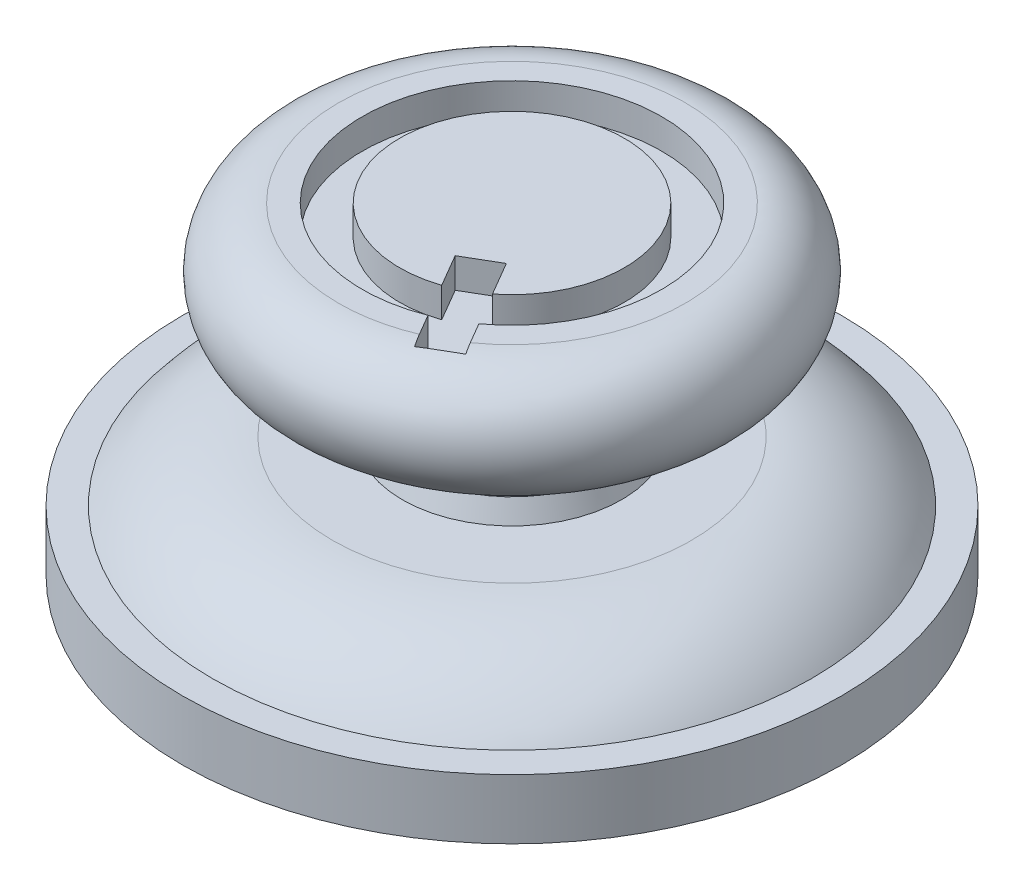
ISO-10303-21;
HEADER;
FILE_DESCRIPTION(('STEP AP214'),'2;1');
FILE_NAME('part.step','',(''),(''),'','','');
FILE_SCHEMA(('AUTOMOTIVE_DESIGN { 1 0 10303 214 1 1 1 1 }'));
ENDSEC;
DATA;
#1=APPLICATION_CONTEXT('core data for automotive mechanical design processes');
#2=APPLICATION_PROTOCOL_DEFINITION('international standard','automotive_design',2000,#1);
#3=PRODUCT_CONTEXT('',#1,'mechanical');
#4=PRODUCT('Part','Part','',(#3));
#5=PRODUCT_RELATED_PRODUCT_CATEGORY('part','',(#4));
#6=PRODUCT_DEFINITION_FORMATION('','',#4);
#7=PRODUCT_DEFINITION_CONTEXT('part definition',#1,'design');
#8=PRODUCT_DEFINITION('design','',#6,#7);
#9=PRODUCT_DEFINITION_SHAPE('','',#8);
#10=(LENGTH_UNIT() NAMED_UNIT(*) SI_UNIT(.MILLI.,.METRE.));
#11=(NAMED_UNIT(*) PLANE_ANGLE_UNIT() SI_UNIT($,.RADIAN.));
#12=(NAMED_UNIT(*) SI_UNIT($,.STERADIAN.) SOLID_ANGLE_UNIT());
#13=UNCERTAINTY_MEASURE_WITH_UNIT(LENGTH_MEASURE(1.E-05),#10,'distance_accuracy_value','');
#14=(GEOMETRIC_REPRESENTATION_CONTEXT(3) GLOBAL_UNCERTAINTY_ASSIGNED_CONTEXT((#13)) GLOBAL_UNIT_ASSIGNED_CONTEXT((#10,
#11,#12)) REPRESENTATION_CONTEXT('',''));
#15=CARTESIAN_POINT('',(0.,0.,0.));
#16=DIRECTION('',(0.,0.,1.));
#17=DIRECTION('',(1.,0.,0.));
#18=AXIS2_PLACEMENT_3D('',#15,#16,#17);
#19=CARTESIAN_POINT('',(0.,5.75,0.));
#20=DIRECTION('',(0.,1.,0.));
#21=DIRECTION('',(0.,0.,1.));
#22=AXIS2_PLACEMENT_3D('',#19,#20,#21);
#23=PLANE('',#22);
#24=DIRECTION('',(-0.504080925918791,0.,-0.863656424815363));
#25=VECTOR('',#24,1.);
#26=CARTESIAN_POINT('',(3.55381813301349,5.75,5.09695513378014));
#27=LINE('',#26,#25);
#28=CARTESIAN_POINT('',(3.34157777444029,5.75,4.73331759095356));
#29=VERTEX_POINT('',#28);
#30=CARTESIAN_POINT('',(2.93959915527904,5.75,4.04459600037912));
#31=VERTEX_POINT('',#30);
#32=EDGE_CURVE('E173',#29,#31,#27,.T.);
#33=ORIENTED_EDGE('',*,*,#32,.F.);
#34=CARTESIAN_POINT('',(0.,5.75,0.));
#35=DIRECTION('',(0.,1.,0.));
#36=DIRECTION('',(0.,0.,1.));
#37=AXIS2_PLACEMENT_3D('',#34,#35,#36);
#38=CIRCLE('',#37,5.79400012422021);
#39=CARTESIAN_POINT('',(2.24833037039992,5.75,5.3399857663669));
#40=VERTEX_POINT('',#39);
#41=EDGE_CURVE('E243',#29,#40,#38,.T.);
#42=ORIENTED_EDGE('',*,*,#41,.T.);
#43=DIRECTION('',(0.504080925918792,0.,0.863656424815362));
#44=VECTOR('',#43,1.);
#45=CARTESIAN_POINT('',(1.84414644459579,5.75,4.64748576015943));
#46=LINE('',#45,#44);
#47=CARTESIAN_POINT('',(1.84414644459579,5.75,4.64748576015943));
#48=VERTEX_POINT('',#47);
#49=EDGE_CURVE('E67',#48,#40,#46,.T.);
#50=ORIENTED_EDGE('',*,*,#49,.F.);
#51=CARTESIAN_POINT('',(0.,5.75,0.));
#52=DIRECTION('',(0.,1.,0.));
#53=DIRECTION('',(0.,0.,1.));
#54=AXIS2_PLACEMENT_3D('',#51,#52,#53);
#55=CIRCLE('',#54,5.);
#56=EDGE_CURVE('E162',#31,#48,#55,.T.);
#57=ORIENTED_EDGE('',*,*,#56,.F.);
#58=EDGE_LOOP('',(#33,#42,#50,#57));
#59=FACE_BOUND('',#58,.T.);
#60=ADVANCED_FACE('F39',(#59),#23,.T.);
#61=CARTESIAN_POINT('',(0.,3.78797701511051,0.));
#62=DIRECTION('',(0.,1.,0.));
#63=DIRECTION('',(0.,0.,1.));
#64=AXIS2_PLACEMENT_3D('',#61,#62,#63);
#65=TOROIDAL_SURFACE('',#64,5.79400012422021,1.96202298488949);
#66=CARTESIAN_POINT('',(3.5539348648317,5.70456076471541,5.09715513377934));
#67=CARTESIAN_POINT('',(3.52619326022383,5.71657600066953,5.04962464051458));
#68=CARTESIAN_POINT('',(3.49820651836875,5.72622759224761,5.00167414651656));
#69=CARTESIAN_POINT('',(3.44191960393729,5.74075647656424,4.90523614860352));
#70=CARTESIAN_POINT('',(3.41361942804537,5.74563371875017,4.85674863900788));
#71=CARTESIAN_POINT('',(3.33002933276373,5.75290142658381,4.71353131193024));
#72=CARTESIAN_POINT('',(3.27454975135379,5.74856746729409,4.61847654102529));
#73=CARTESIAN_POINT('',(3.17195508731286,5.72349319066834,4.44269813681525));
#74=CARTESIAN_POINT('',(3.12469518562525,5.70497319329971,4.36172638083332));
#75=CARTESIAN_POINT('',(3.03093741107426,5.65409244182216,4.20108847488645));
#76=CARTESIAN_POINT('',(2.98448205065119,5.6214232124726,4.12149516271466));
#77=CARTESIAN_POINT('',(2.93948242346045,5.58205952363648,4.04439600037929));
#78=B_SPLINE_CURVE_WITH_KNOTS('',3,(#66,#67,#68,#69,#70,#71,#72,#73,#74,#75,#76,#77),
.UNSPECIFIED.,.F.,.F.,(4,2,2,2,2,4),(0.,0.168881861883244,0.337765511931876,0.666517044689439,
0.952263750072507,1.24458119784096),.UNSPECIFIED.);
#79=CARTESIAN_POINT('',(3.55381813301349,5.70461130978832,5.09695513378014));
#80=VERTEX_POINT('',#79);
#81=EDGE_CURVE('E11',#80,#29,#78,.T.);
#82=ORIENTED_EDGE('',*,*,#81,.F.);
#83=CARTESIAN_POINT('',(2.47404760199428,5.69893829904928,5.72717302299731));
#84=CARTESIAN_POINT('',(2.56402567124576,5.70183304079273,5.67465650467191));
#85=CARTESIAN_POINT('',(2.65401838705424,5.7040413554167,5.62213143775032));
#86=CARTESIAN_POINT('',(2.83400938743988,5.70722978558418,5.51707805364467));
#87=CARTESIAN_POINT('',(2.92400767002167,5.70821004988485,5.46454973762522));
#88=CARTESIAN_POINT('',(3.10400704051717,5.70908766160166,5.35949146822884));
#89=CARTESIAN_POINT('',(3.19400812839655,5.70898501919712,5.30696151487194));
#90=CARTESIAN_POINT('',(3.37401489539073,5.70765265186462,5.20189892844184));
#91=CARTESIAN_POINT('',(3.46402057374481,5.70642279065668,5.14936629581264));
#92=CARTESIAN_POINT('',(3.55401813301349,5.70460722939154,5.09683840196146));
#93=B_SPLINE_CURVE_WITH_KNOTS('',3,(#83,#84,#85,#86,#87,#88,#89,#90,#91,#92),.UNSPECIFIED.,.F.,
.F.,(4,2,2,2,4),(0.,0.31266333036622,0.625288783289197,0.937911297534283,1.25057161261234),.UNSPECIFIED.);
#94=CARTESIAN_POINT('',(2.47424760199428,5.69894477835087,5.72705629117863));
#95=VERTEX_POINT('',#94);
#96=EDGE_CURVE('E52',#95,#80,#93,.T.);
#97=ORIENTED_EDGE('',*,*,#96,.F.);
#98=CARTESIAN_POINT('',(1.84402971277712,5.58206016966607,4.64728576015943));
#99=CARTESIAN_POINT('',(1.87033689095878,5.60490191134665,4.69235860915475));
#100=CARTESIAN_POINT('',(1.89712323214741,5.62550484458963,4.7382524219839));
#101=CARTESIAN_POINT('',(1.95148320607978,5.66211251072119,4.83138893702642));
#102=CARTESIAN_POINT('',(1.97905685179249,5.678117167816,4.87863166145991));
#103=CARTESIAN_POINT('',(2.06118898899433,5.71831192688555,5.01935102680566));
#104=CARTESIAN_POINT('',(2.11660471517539,5.73592760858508,5.11429639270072));
#105=CARTESIAN_POINT('',(2.22230058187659,5.75180482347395,5.29538817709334));
#106=CARTESIAN_POINT('',(2.27251382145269,5.75189263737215,5.38141997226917));
#107=CARTESIAN_POINT('',(2.34799295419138,5.74082861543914,5.51074055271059));
#108=CARTESIAN_POINT('',(2.37348453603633,5.73513647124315,5.55441601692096));
#109=CARTESIAN_POINT('',(2.42417693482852,5.71989723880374,5.6412687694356));
#110=CARTESIAN_POINT('',(2.44937770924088,5.71034959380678,5.68444598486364));
#111=CARTESIAN_POINT('',(2.47436433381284,5.69889126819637,5.72725629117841));
#112=B_SPLINE_CURVE_WITH_KNOTS('',3,(#98,#99,#100,#101,#102,#103,#104,#105,#106,#107,#108,#109,
#110,#111),.UNSPECIFIED.,.F.,.F.,(4,2,2,2,2,2,4),(0.,0.170799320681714,0.341601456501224,
0.673943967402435,0.971638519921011,1.12417409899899,1.27673171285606),.UNSPECIFIED.);
#113=EDGE_CURVE('E247',#40,#95,#112,.T.);
#114=ORIENTED_EDGE('',*,*,#113,.F.);
#115=ORIENTED_EDGE('',*,*,#41,.F.);
#116=EDGE_LOOP('',(#82,#97,#114,#115));
#117=FACE_BOUND('',#116,.T.);
#118=CARTESIAN_POINT('',(0.,1.82595403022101,0.));
#119=DIRECTION('',(0.,1.,0.));
#120=DIRECTION('',(0.,0.,1.));
#121=AXIS2_PLACEMENT_3D('',#118,#119,#120);
#122=CIRCLE('',#121,5.79400012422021);
#123=CARTESIAN_POINT('',(0.,1.82595403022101,5.79400012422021));
#124=VERTEX_POINT('',#123);
#125=EDGE_CURVE('E239',#124,#124,#122,.T.);
#126=ORIENTED_EDGE('',*,*,#125,.T.);
#127=EDGE_LOOP('',(#126));
#128=FACE_BOUND('',#127,.T.);
#129=ADVANCED_FACE('F259',(#117,#128),#65,.T.);
#130=CARTESIAN_POINT('',(0.,-0.56270348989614,0.));
#131=DIRECTION('',(0.,1.,0.));
#132=DIRECTION('',(0.,0.,1.));
#133=AXIS2_PLACEMENT_3D('',#130,#131,#132);
#134=TOROIDAL_SURFACE('',#133,5.79400012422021,2.38865752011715);
#135=CARTESIAN_POINT('',(0.,-0.32992249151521,0.));
#136=DIRECTION('',(0.,1.,0.));
#137=DIRECTION('',(0.,0.,1.));
#138=AXIS2_PLACEMENT_3D('',#135,#136,#137);
#139=CIRCLE('',#138,3.41671222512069);
#140=CARTESIAN_POINT('',(0.,-0.32992249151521,3.41671222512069));
#141=VERTEX_POINT('',#140);
#142=EDGE_CURVE('E235',#141,#141,#139,.T.);
#143=ORIENTED_EDGE('',*,*,#142,.T.);
#144=EDGE_LOOP('',(#143));
#145=FACE_BOUND('',#144,.T.);
#146=ORIENTED_EDGE('',*,*,#125,.F.);
#147=EDGE_LOOP('',(#146));
#148=FACE_BOUND('',#147,.T.);
#149=ADVANCED_FACE('F303',(#145,#148),#134,.F.);
#150=CARTESIAN_POINT('',(0.,-0.32992249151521,0.));
#151=DIRECTION('',(0.,-1.,0.));
#152=DIRECTION('',(0.,0.,-1.));
#153=AXIS2_PLACEMENT_3D('',#150,#151,#152);
#154=CONICAL_SURFACE('',#153,3.41671222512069,0.349065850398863);
#155=CARTESIAN_POINT('',(0.,-0.999644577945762,0.));
#156=DIRECTION('',(0.,1.,0.));
#157=DIRECTION('',(0.,0.,1.));
#158=AXIS2_PLACEMENT_3D('',#155,#156,#157);
#159=CIRCLE('',#158,3.66047112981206);
#160=CARTESIAN_POINT('',(0.,-0.999644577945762,3.66047112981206));
#161=VERTEX_POINT('',#160);
#162=EDGE_CURVE('E231',#161,#161,#159,.T.);
#163=ORIENTED_EDGE('',*,*,#162,.T.);
#164=EDGE_LOOP('',(#163));
#165=FACE_BOUND('',#164,.T.);
#166=ORIENTED_EDGE('',*,*,#142,.F.);
#167=EDGE_LOOP('',(#166));
#168=FACE_BOUND('',#167,.T.);
#169=ADVANCED_FACE('F300',(#165,#168),#154,.T.);
#170=CARTESIAN_POINT('',(-3.66047112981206,-0.999644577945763,0.));
#171=DIRECTION('',(0.,1.,0.));
#172=DIRECTION('',(0.,0.,1.));
#173=AXIS2_PLACEMENT_3D('',#170,#171,#172);
#174=PLANE('',#173);
#175=CARTESIAN_POINT('',(0.,-0.999644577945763,0.));
#176=DIRECTION('',(0.,1.,0.));
#177=DIRECTION('',(0.,0.,1.));
#178=AXIS2_PLACEMENT_3D('',#175,#176,#177);
#179=CIRCLE('',#178,6.);
#180=CARTESIAN_POINT('',(0.,-0.999644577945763,6.));
#181=VERTEX_POINT('',#180);
#182=EDGE_CURVE('E227',#181,#181,#179,.T.);
#183=ORIENTED_EDGE('',*,*,#182,.T.);
#184=EDGE_LOOP('',(#183));
#185=FACE_BOUND('',#184,.T.);
#186=ORIENTED_EDGE('',*,*,#162,.F.);
#187=EDGE_LOOP('',(#186));
#188=FACE_BOUND('',#187,.T.);
#189=ADVANCED_FACE('F296',(#185,#188),#174,.T.);
#190=CARTESIAN_POINT('',(0.,-5.99964457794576,0.));
#191=DIRECTION('',(0.,1.,0.));
#192=DIRECTION('',(0.,0.,1.));
#193=AXIS2_PLACEMENT_3D('',#190,#191,#192);
#194=TOROIDAL_SURFACE('',#193,6.,5.);
#195=CARTESIAN_POINT('',(0.,-2.99964457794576,0.));
#196=DIRECTION('',(0.,1.,0.));
#197=DIRECTION('',(0.,0.,1.));
#198=AXIS2_PLACEMENT_3D('',#195,#196,#197);
#199=CIRCLE('',#198,10.);
#200=CARTESIAN_POINT('',(0.,-2.99964457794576,10.));
#201=VERTEX_POINT('',#200);
#202=EDGE_CURVE('E223',#201,#201,#199,.T.);
#203=ORIENTED_EDGE('',*,*,#202,.T.);
#204=EDGE_LOOP('',(#203));
#205=FACE_BOUND('',#204,.T.);
#206=ORIENTED_EDGE('',*,*,#182,.F.);
#207=EDGE_LOOP('',(#206));
#208=FACE_BOUND('',#207,.T.);
#209=ADVANCED_FACE('F292',(#205,#208),#194,.T.);
#210=CARTESIAN_POINT('',(-10.,-2.99964457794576,0.));
#211=DIRECTION('',(0.,1.,0.));
#212=DIRECTION('',(0.,0.,1.));
#213=AXIS2_PLACEMENT_3D('',#210,#211,#212);
#214=PLANE('',#213);
#215=CARTESIAN_POINT('',(0.,-2.99964457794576,0.));
#216=DIRECTION('',(0.,1.,0.));
#217=DIRECTION('',(0.,0.,1.));
#218=AXIS2_PLACEMENT_3D('',#215,#216,#217);
#219=CIRCLE('',#218,11.);
#220=CARTESIAN_POINT('',(0.,-2.99964457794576,11.));
#221=VERTEX_POINT('',#220);
#222=EDGE_CURVE('E219',#221,#221,#219,.T.);
#223=ORIENTED_EDGE('',*,*,#222,.T.);
#224=EDGE_LOOP('',(#223));
#225=FACE_BOUND('',#224,.T.);
#226=ORIENTED_EDGE('',*,*,#202,.F.);
#227=EDGE_LOOP('',(#226));
#228=FACE_BOUND('',#227,.T.);
#229=ADVANCED_FACE('F288',(#225,#228),#214,.T.);
#230=CARTESIAN_POINT('',(0.,8.27404181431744,0.));
#231=DIRECTION('',(0.,1.,0.));
#232=DIRECTION('',(0.,0.,1.));
#233=AXIS2_PLACEMENT_3D('',#230,#231,#232);
#234=CYLINDRICAL_SURFACE('',#233,11.);
#235=CARTESIAN_POINT('',(0.,-4.99964457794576,0.));
#236=DIRECTION('',(0.,1.,0.));
#237=DIRECTION('',(0.,0.,1.));
#238=AXIS2_PLACEMENT_3D('',#235,#236,#237);
#239=CIRCLE('',#238,11.);
#240=CARTESIAN_POINT('',(0.,-4.99964457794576,11.));
#241=VERTEX_POINT('',#240);
#242=EDGE_CURVE('E215',#241,#241,#239,.T.);
#243=ORIENTED_EDGE('',*,*,#242,.T.);
#244=EDGE_LOOP('',(#243));
#245=FACE_BOUND('',#244,.T.);
#246=ORIENTED_EDGE('',*,*,#222,.F.);
#247=EDGE_LOOP('',(#246));
#248=FACE_BOUND('',#247,.T.);
#249=ADVANCED_FACE('F284',(#245,#248),#234,.T.);
#250=CARTESIAN_POINT('',(-11.,-4.99964457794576,0.));
#251=DIRECTION('',(0.,-1.,0.));
#252=DIRECTION('',(0.,0.,-1.));
#253=AXIS2_PLACEMENT_3D('',#250,#251,#252);
#254=PLANE('',#253);
#255=CARTESIAN_POINT('',(0.,-4.99964457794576,0.));
#256=DIRECTION('',(0.,1.,0.));
#257=DIRECTION('',(0.,0.,1.));
#258=AXIS2_PLACEMENT_3D('',#255,#256,#257);
#259=CIRCLE('',#258,10.);
#260=CARTESIAN_POINT('',(0.,-4.99964457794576,10.));
#261=VERTEX_POINT('',#260);
#262=EDGE_CURVE('E211',#261,#261,#259,.T.);
#263=ORIENTED_EDGE('',*,*,#262,.T.);
#264=EDGE_LOOP('',(#263));
#265=FACE_BOUND('',#264,.T.);
#266=ORIENTED_EDGE('',*,*,#242,.F.);
#267=EDGE_LOOP('',(#266));
#268=FACE_BOUND('',#267,.T.);
#269=ADVANCED_FACE('F280',(#265,#268),#254,.T.);
#270=CARTESIAN_POINT('',(0.,8.27404181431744,0.));
#271=DIRECTION('',(0.,1.,0.));
#272=DIRECTION('',(0.,0.,1.));
#273=AXIS2_PLACEMENT_3D('',#270,#271,#272);
#274=CYLINDRICAL_SURFACE('',#273,10.);
#275=CARTESIAN_POINT('',(0.,-3.49964457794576,0.));
#276=DIRECTION('',(0.,1.,0.));
#277=DIRECTION('',(0.,0.,1.));
#278=AXIS2_PLACEMENT_3D('',#275,#276,#277);
#279=CIRCLE('',#278,10.);
#280=CARTESIAN_POINT('',(0.,-3.49964457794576,10.));
#281=VERTEX_POINT('',#280);
#282=EDGE_CURVE('E197',#281,#281,#279,.T.);
#283=ORIENTED_EDGE('',*,*,#282,.T.);
#284=EDGE_LOOP('',(#283));
#285=FACE_BOUND('',#284,.T.);
#286=ORIENTED_EDGE('',*,*,#262,.F.);
#287=EDGE_LOOP('',(#286));
#288=FACE_BOUND('',#287,.T.);
#289=ADVANCED_FACE('F276',(#285,#288),#274,.F.);
#290=CARTESIAN_POINT('',(-10.,-3.49964457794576,0.));
#291=DIRECTION('',(0.,-1.,0.));
#292=DIRECTION('',(0.,0.,-1.));
#293=AXIS2_PLACEMENT_3D('',#290,#291,#292);
#294=PLANE('',#293);
#295=ORIENTED_EDGE('',*,*,#282,.F.);
#296=EDGE_LOOP('',(#295));
#297=FACE_BOUND('',#296,.T.);
#298=ADVANCED_FACE('F272',(#297),#294,.T.);
#299=CARTESIAN_POINT('',(0.,4.75,0.));
#300=DIRECTION('',(0.,1.,0.));
#301=DIRECTION('',(0.,0.,1.));
#302=AXIS2_PLACEMENT_3D('',#299,#300,#301);
#303=CYLINDRICAL_SURFACE('',#302,5.);
#304=ORIENTED_EDGE('',*,*,#56,.T.);
#305=DIRECTION('',(0.,1.,0.));
#306=VECTOR('',#305,1.);
#307=CARTESIAN_POINT('',(1.84414644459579,4.75,4.64748576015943));
#308=LINE('',#307,#306);
#309=CARTESIAN_POINT('',(1.84414644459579,4.75,4.64748576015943));
#310=VERTEX_POINT('',#309);
#311=EDGE_CURVE('E185',#310,#48,#308,.T.);
#312=ORIENTED_EDGE('',*,*,#311,.F.);
#313=CARTESIAN_POINT('',(0.,4.75,0.));
#314=DIRECTION('',(0.,1.,0.));
#315=DIRECTION('',(0.,0.,1.));
#316=AXIS2_PLACEMENT_3D('',#313,#314,#315);
#317=CIRCLE('',#316,5.);
#318=CARTESIAN_POINT('',(2.93959915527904,4.75,4.04459600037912));
#319=VERTEX_POINT('',#318);
#320=EDGE_CURVE('E168',#319,#310,#317,.T.);
#321=ORIENTED_EDGE('',*,*,#320,.F.);
#322=DIRECTION('',(0.,1.,0.));
#323=VECTOR('',#322,1.);
#324=CARTESIAN_POINT('',(2.93959915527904,4.75,4.04459600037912));
#325=LINE('',#324,#323);
#326=EDGE_CURVE('E193',#319,#31,#325,.T.);
#327=ORIENTED_EDGE('',*,*,#326,.T.);
#328=EDGE_LOOP('',(#304,#312,#321,#327));
#329=FACE_BOUND('',#328,.T.);
#330=ADVANCED_FACE('F268',(#329),#303,.F.);
#331=CARTESIAN_POINT('',(3.55381813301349,4.75,5.09695513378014));
#332=DIRECTION('',(0.863656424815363,0.,-0.504080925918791));
#333=DIRECTION('',(-0.504080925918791,0.,-0.863656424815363));
#334=AXIS2_PLACEMENT_3D('',#331,#332,#333);
#335=PLANE('',#334);
#336=ORIENTED_EDGE('',*,*,#81,.T.);
#337=ORIENTED_EDGE('',*,*,#32,.T.);
#338=ORIENTED_EDGE('',*,*,#326,.F.);
#339=DIRECTION('',(-0.504080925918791,0.,-0.863656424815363));
#340=VECTOR('',#339,1.);
#341=CARTESIAN_POINT('',(3.55381813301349,4.75,5.09695513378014));
#342=LINE('',#341,#340);
#343=CARTESIAN_POINT('',(3.55381813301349,4.75,5.09695513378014));
#344=VERTEX_POINT('',#343);
#345=EDGE_CURVE('E181',#344,#319,#342,.T.);
#346=ORIENTED_EDGE('',*,*,#345,.F.);
#347=DIRECTION('',(0.,1.,0.));
#348=VECTOR('',#347,1.);
#349=CARTESIAN_POINT('',(3.55381813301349,4.75,5.09695513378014));
#350=LINE('',#349,#348);
#351=EDGE_CURVE('E198',#344,#80,#350,.T.);
#352=ORIENTED_EDGE('',*,*,#351,.T.);
#353=EDGE_LOOP('',(#336,#337,#338,#346,#352));
#354=FACE_BOUND('',#353,.T.);
#355=ADVANCED_FACE('F271',(#354),#335,.F.);
#356=CARTESIAN_POINT('',(2.47424760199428,4.75,5.72705629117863));
#357=DIRECTION('',(0.504080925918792,0.,0.863656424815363));
#358=DIRECTION('',(0.863656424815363,0.,-0.504080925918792));
#359=AXIS2_PLACEMENT_3D('',#356,#357,#358);
#360=PLANE('',#359);
#361=ORIENTED_EDGE('',*,*,#96,.T.);
#362=ORIENTED_EDGE('',*,*,#351,.F.);
#363=DIRECTION('',(0.863656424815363,0.,-0.504080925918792));
#364=VECTOR('',#363,1.);
#365=CARTESIAN_POINT('',(2.47424760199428,4.75,5.72705629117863));
#366=LINE('',#365,#364);
#367=CARTESIAN_POINT('',(2.47424760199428,4.75,5.72705629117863));
#368=VERTEX_POINT('',#367);
#369=EDGE_CURVE('E177',#368,#344,#366,.T.);
#370=ORIENTED_EDGE('',*,*,#369,.F.);
#371=DIRECTION('',(0.,1.,0.));
#372=VECTOR('',#371,1.);
#373=CARTESIAN_POINT('',(2.47424760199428,4.75,5.72705629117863));
#374=LINE('',#373,#372);
#375=EDGE_CURVE('E202',#368,#95,#374,.T.);
#376=ORIENTED_EDGE('',*,*,#375,.T.);
#377=EDGE_LOOP('',(#361,#362,#370,#376));
#378=FACE_BOUND('',#377,.T.);
#379=ADVANCED_FACE('F266',(#378),#360,.F.);
#380=CARTESIAN_POINT('',(1.84414644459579,4.75,4.64748576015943));
#381=DIRECTION('',(-0.863656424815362,0.,0.504080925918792));
#382=DIRECTION('',(0.504080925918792,0.,0.863656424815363));
#383=AXIS2_PLACEMENT_3D('',#380,#381,#382);
#384=PLANE('',#383);
#385=ORIENTED_EDGE('',*,*,#113,.T.);
#386=ORIENTED_EDGE('',*,*,#375,.F.);
#387=DIRECTION('',(0.504080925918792,0.,0.863656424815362));
#388=VECTOR('',#387,1.);
#389=CARTESIAN_POINT('',(1.84414644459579,4.75,4.64748576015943));
#390=LINE('',#389,#388);
#391=EDGE_CURVE('E172',#310,#368,#390,.T.);
#392=ORIENTED_EDGE('',*,*,#391,.F.);
#393=ORIENTED_EDGE('',*,*,#311,.T.);
#394=ORIENTED_EDGE('',*,*,#49,.T.);
#395=EDGE_LOOP('',(#385,#386,#392,#393,#394));
#396=FACE_BOUND('',#395,.T.);
#397=ADVANCED_FACE('F262',(#396),#384,.F.);
#398=CARTESIAN_POINT('',(0.,4.75,0.));
#399=DIRECTION('',(0.,1.,0.));
#400=DIRECTION('',(0.,0.,1.));
#401=AXIS2_PLACEMENT_3D('',#398,#399,#400);
#402=PLANE('',#401);
#403=DIRECTION('',(-0.504080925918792,0.,-0.863656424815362));
#404=VECTOR('',#403,1.);
#405=CARTESIAN_POINT('',(0.57426811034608,4.75,2.47176649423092));
#406=LINE('',#405,#404);
#407=CARTESIAN_POINT('',(1.20436926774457,4.75,3.55133702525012));
#408=VERTEX_POINT('',#407);
#409=CARTESIAN_POINT('',(0.57426811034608,4.75,2.47176649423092));
#410=VERTEX_POINT('',#409);
#411=EDGE_CURVE('E127',#408,#410,#406,.T.);
#412=ORIENTED_EDGE('',*,*,#411,.F.);
#413=CARTESIAN_POINT('',(0.,4.75,0.));
#414=DIRECTION('',(0.,1.,0.));
#415=DIRECTION('',(0.,0.,1.));
#416=AXIS2_PLACEMENT_3D('',#413,#414,#415);
#417=CIRCLE('',#416,3.75);
#418=CARTESIAN_POINT('',(2.30525363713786,4.75,2.95775348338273));
#419=VERTEX_POINT('',#418);
#420=EDGE_CURVE('E137',#419,#408,#417,.T.);
#421=ORIENTED_EDGE('',*,*,#420,.F.);
#422=DIRECTION('',(0.504080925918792,0.,0.863656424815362));
#423=VECTOR('',#422,1.);
#424=CARTESIAN_POINT('',(2.30525363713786,4.75,2.95775348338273));
#425=LINE('',#424,#423);
#426=CARTESIAN_POINT('',(1.65383864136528,4.75,1.84166533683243));
#427=VERTEX_POINT('',#426);
#428=EDGE_CURVE('E118',#427,#419,#425,.T.);
#429=ORIENTED_EDGE('',*,*,#428,.F.);
#430=DIRECTION('',(0.863656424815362,0.,-0.504080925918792));
#431=VECTOR('',#430,1.);
#432=CARTESIAN_POINT('',(1.65383864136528,4.75,1.84166533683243));
#433=LINE('',#432,#431);
#434=EDGE_CURVE('E134',#410,#427,#433,.T.);
#435=ORIENTED_EDGE('',*,*,#434,.F.);
#436=EDGE_LOOP('',(#412,#421,#429,#435));
#437=FACE_BOUND('',#436,.T.);
#438=ORIENTED_EDGE('',*,*,#320,.T.);
#439=ORIENTED_EDGE('',*,*,#391,.T.);
#440=ORIENTED_EDGE('',*,*,#369,.T.);
#441=ORIENTED_EDGE('',*,*,#345,.T.);
#442=EDGE_LOOP('',(#438,#439,#440,#441));
#443=FACE_BOUND('',#442,.T.);
#444=ADVANCED_FACE('F132',(#437,#443),#402,.T.);
#445=CARTESIAN_POINT('',(1.65383864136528,4.75,1.84166533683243));
#446=DIRECTION('',(0.504080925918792,0.,0.863656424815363));
#447=DIRECTION('',(0.863656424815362,0.,-0.504080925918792));
#448=AXIS2_PLACEMENT_3D('',#445,#446,#447);
#449=PLANE('',#448);
#450=DIRECTION('',(0.863656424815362,0.,-0.504080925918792));
#451=VECTOR('',#450,1.);
#452=CARTESIAN_POINT('',(1.65383864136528,5.75,1.84166533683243));
#453=LINE('',#452,#451);
#454=CARTESIAN_POINT('',(0.57426811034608,5.75,2.47176649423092));
#455=VERTEX_POINT('',#454);
#456=CARTESIAN_POINT('',(1.65383864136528,5.75,1.84166533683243));
#457=VERTEX_POINT('',#456);
#458=EDGE_CURVE('E153',#455,#457,#453,.T.);
#459=ORIENTED_EDGE('',*,*,#458,.F.);
#460=DIRECTION('',(0.,1.,0.));
#461=VECTOR('',#460,1.);
#462=CARTESIAN_POINT('',(0.57426811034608,4.75,2.47176649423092));
#463=LINE('',#462,#461);
#464=EDGE_CURVE('E141',#410,#455,#463,.T.);
#465=ORIENTED_EDGE('',*,*,#464,.F.);
#466=ORIENTED_EDGE('',*,*,#434,.T.);
#467=DIRECTION('',(0.,1.,0.));
#468=VECTOR('',#467,1.);
#469=CARTESIAN_POINT('',(1.65383864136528,4.75,1.84166533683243));
#470=LINE('',#469,#468);
#471=EDGE_CURVE('E115',#427,#457,#470,.T.);
#472=ORIENTED_EDGE('',*,*,#471,.T.);
#473=EDGE_LOOP('',(#459,#465,#466,#472));
#474=FACE_BOUND('',#473,.T.);
#475=ADVANCED_FACE('F140',(#474),#449,.T.);
#476=CARTESIAN_POINT('',(0.57426811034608,4.75,2.47176649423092));
#477=DIRECTION('',(0.863656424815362,0.,-0.504080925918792));
#478=DIRECTION('',(-0.504080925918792,0.,-0.863656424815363));
#479=AXIS2_PLACEMENT_3D('',#476,#477,#478);
#480=PLANE('',#479);
#481=DIRECTION('',(-0.504080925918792,0.,-0.863656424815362));
#482=VECTOR('',#481,1.);
#483=CARTESIAN_POINT('',(0.57426811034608,5.75,2.47176649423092));
#484=LINE('',#483,#482);
#485=CARTESIAN_POINT('',(1.20436926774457,5.75,3.55133702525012));
#486=VERTEX_POINT('',#485);
#487=EDGE_CURVE('E143',#486,#455,#484,.T.);
#488=ORIENTED_EDGE('',*,*,#487,.F.);
#489=DIRECTION('',(0.,1.,0.));
#490=VECTOR('',#489,1.);
#491=CARTESIAN_POINT('',(1.20436926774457,4.75,3.55133702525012));
#492=LINE('',#491,#490);
#493=EDGE_CURVE('E163',#408,#486,#492,.T.);
#494=ORIENTED_EDGE('',*,*,#493,.F.);
#495=ORIENTED_EDGE('',*,*,#411,.T.);
#496=ORIENTED_EDGE('',*,*,#464,.T.);
#497=EDGE_LOOP('',(#488,#494,#495,#496));
#498=FACE_BOUND('',#497,.T.);
#499=ADVANCED_FACE('F327',(#498),#480,.T.);
#500=CARTESIAN_POINT('',(0.,4.75,0.));
#501=DIRECTION('',(0.,1.,0.));
#502=DIRECTION('',(0.,0.,1.));
#503=AXIS2_PLACEMENT_3D('',#500,#501,#502);
#504=CYLINDRICAL_SURFACE('',#503,3.75);
#505=CARTESIAN_POINT('',(0.,5.75,0.));
#506=DIRECTION('',(0.,1.,0.));
#507=DIRECTION('',(0.,0.,1.));
#508=AXIS2_PLACEMENT_3D('',#505,#506,#507);
#509=CIRCLE('',#508,3.75);
#510=CARTESIAN_POINT('',(2.30525363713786,5.75,2.95775348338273));
#511=VERTEX_POINT('',#510);
#512=EDGE_CURVE('E59',#511,#486,#509,.T.);
#513=ORIENTED_EDGE('',*,*,#512,.F.);
#514=DIRECTION('',(0.,1.,0.));
#515=VECTOR('',#514,1.);
#516=CARTESIAN_POINT('',(2.30525363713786,4.75,2.95775348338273));
#517=LINE('',#516,#515);
#518=EDGE_CURVE('E126',#419,#511,#517,.T.);
#519=ORIENTED_EDGE('',*,*,#518,.F.);
#520=ORIENTED_EDGE('',*,*,#420,.T.);
#521=ORIENTED_EDGE('',*,*,#493,.T.);
#522=EDGE_LOOP('',(#513,#519,#520,#521));
#523=FACE_BOUND('',#522,.T.);
#524=ADVANCED_FACE('F323',(#523),#504,.T.);
#525=CARTESIAN_POINT('',(2.30525363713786,4.75,2.95775348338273));
#526=DIRECTION('',(-0.863656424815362,0.,0.504080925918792));
#527=DIRECTION('',(0.504080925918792,0.,0.863656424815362));
#528=AXIS2_PLACEMENT_3D('',#525,#526,#527);
#529=PLANE('',#528);
#530=DIRECTION('',(0.504080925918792,0.,0.863656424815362));
#531=VECTOR('',#530,1.);
#532=CARTESIAN_POINT('',(2.30525363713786,5.75,2.95775348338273));
#533=LINE('',#532,#531);
#534=EDGE_CURVE('E120',#457,#511,#533,.T.);
#535=ORIENTED_EDGE('',*,*,#534,.F.);
#536=ORIENTED_EDGE('',*,*,#471,.F.);
#537=ORIENTED_EDGE('',*,*,#428,.T.);
#538=ORIENTED_EDGE('',*,*,#518,.T.);
#539=EDGE_LOOP('',(#535,#536,#537,#538));
#540=FACE_BOUND('',#539,.T.);
#541=ADVANCED_FACE('F117',(#540),#529,.T.);
#542=ORIENTED_EDGE('',*,*,#487,.T.);
#543=ORIENTED_EDGE('',*,*,#458,.T.);
#544=ORIENTED_EDGE('',*,*,#534,.T.);
#545=ORIENTED_EDGE('',*,*,#512,.T.);
#546=EDGE_LOOP('',(#542,#543,#544,#545));
#547=FACE_BOUND('',#546,.T.);
#548=ADVANCED_FACE('F314',(#547),#23,.T.);
#549=CLOSED_SHELL('',(#60,#129,#149,#169,#189,#209,#229,#249,#269,#289,#298,#330,#355,#379,#397,
#444,#475,#499,#524,#541,#548));
#550=MANIFOLD_SOLID_BREP('B2',#549);
#551=ADVANCED_BREP_SHAPE_REPRESENTATION('',(#18,#550),#14);
#552=SHAPE_DEFINITION_REPRESENTATION(#9,#551);
ENDSEC;
END-ISO-10303-21;
